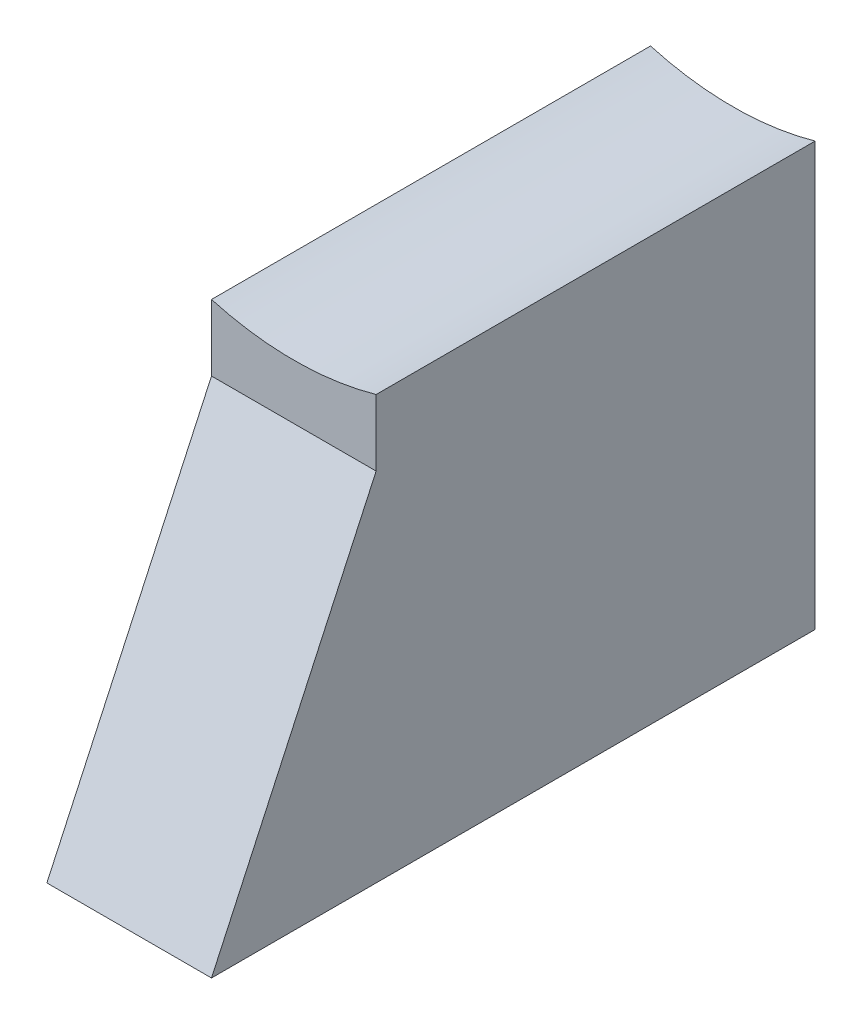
ISO-10303-21;
HEADER;
FILE_DESCRIPTION(('STEP AP214'),'2;1');
FILE_NAME('part.step','',(''),(''),'','','');
FILE_SCHEMA(('AUTOMOTIVE_DESIGN { 1 0 10303 214 1 1 1 1 }'));
ENDSEC;
DATA;
#1=APPLICATION_CONTEXT('core data for automotive mechanical design processes');
#2=APPLICATION_PROTOCOL_DEFINITION('international standard','automotive_design',2000,#1);
#3=PRODUCT_CONTEXT('',#1,'mechanical');
#4=PRODUCT('Part','Part','',(#3));
#5=PRODUCT_RELATED_PRODUCT_CATEGORY('part','',(#4));
#6=PRODUCT_DEFINITION_FORMATION('','',#4);
#7=PRODUCT_DEFINITION_CONTEXT('part definition',#1,'design');
#8=PRODUCT_DEFINITION('design','',#6,#7);
#9=PRODUCT_DEFINITION_SHAPE('','',#8);
#10=(LENGTH_UNIT() NAMED_UNIT(*) SI_UNIT(.MILLI.,.METRE.));
#11=(NAMED_UNIT(*) PLANE_ANGLE_UNIT() SI_UNIT($,.RADIAN.));
#12=(NAMED_UNIT(*) SI_UNIT($,.STERADIAN.) SOLID_ANGLE_UNIT());
#13=UNCERTAINTY_MEASURE_WITH_UNIT(LENGTH_MEASURE(1.E-05),#10,'distance_accuracy_value','');
#14=(GEOMETRIC_REPRESENTATION_CONTEXT(3) GLOBAL_UNCERTAINTY_ASSIGNED_CONTEXT((#13)) GLOBAL_UNIT_ASSIGNED_CONTEXT((#10,
#11,#12)) REPRESENTATION_CONTEXT('',''));
#15=CARTESIAN_POINT('',(0.,0.,0.));
#16=DIRECTION('',(0.,0.,1.));
#17=DIRECTION('',(1.,0.,0.));
#18=AXIS2_PLACEMENT_3D('',#15,#16,#17);
#19=CARTESIAN_POINT('',(3.,6.,22.));
#20=DIRECTION('',(0.,-0.419058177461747,-0.907959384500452));
#21=DIRECTION('',(0.,0.907959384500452,-0.419058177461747));
#22=AXIS2_PLACEMENT_3D('',#19,#20,#21);
#23=PLANE('',#22);
#24=DIRECTION('',(0.,-0.907959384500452,0.419058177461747));
#25=VECTOR('',#24,1.);
#26=CARTESIAN_POINT('',(-3.,6.,22.));
#27=LINE('',#26,#25);
#28=CARTESIAN_POINT('',(-3.,19.,16.));
#29=VERTEX_POINT('',#28);
#30=CARTESIAN_POINT('',(-3.,6.00000000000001,22.));
#31=VERTEX_POINT('',#30);
#32=EDGE_CURVE('E95',#29,#31,#27,.T.);
#33=ORIENTED_EDGE('',*,*,#32,.T.);
#34=DIRECTION('',(-1.,0.,0.));
#35=VECTOR('',#34,1.);
#36=CARTESIAN_POINT('',(3.,6.,22.));
#37=LINE('',#36,#35);
#38=CARTESIAN_POINT('',(3.,6.,22.));
#39=VERTEX_POINT('',#38);
#40=EDGE_CURVE('E92',#39,#31,#37,.T.);
#41=ORIENTED_EDGE('',*,*,#40,.F.);
#42=DIRECTION('',(0.,-0.907959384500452,0.419058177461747));
#43=VECTOR('',#42,1.);
#44=CARTESIAN_POINT('',(3.,6.,22.));
#45=LINE('',#44,#43);
#46=CARTESIAN_POINT('',(3.,19.,16.));
#47=VERTEX_POINT('',#46);
#48=EDGE_CURVE('E111',#47,#39,#45,.T.);
#49=ORIENTED_EDGE('',*,*,#48,.F.);
#50=DIRECTION('',(-1.,0.,0.));
#51=VECTOR('',#50,1.);
#52=CARTESIAN_POINT('',(3.,19.,16.));
#53=LINE('',#52,#51);
#54=EDGE_CURVE('E117',#47,#29,#53,.T.);
#55=ORIENTED_EDGE('',*,*,#54,.T.);
#56=EDGE_LOOP('',(#33,#41,#49,#55));
#57=FACE_BOUND('',#56,.T.);
#58=ADVANCED_FACE('F34',(#57),#23,.F.);
#59=CARTESIAN_POINT('',(-3.,22.8369591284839,16.));
#60=DIRECTION('',(-1.,0.,0.));
#61=DIRECTION('',(0.,0.,1.));
#62=AXIS2_PLACEMENT_3D('',#59,#60,#61);
#63=PLANE('',#62);
#64=DIRECTION('',(0.,0.,-1.));
#65=VECTOR('',#64,1.);
#66=CARTESIAN_POINT('',(-3.,21.4169947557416,18.));
#67=LINE('',#66,#65);
#68=CARTESIAN_POINT('',(-3.,21.4169947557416,0.));
#69=VERTEX_POINT('',#68);
#70=CARTESIAN_POINT('',(-3.,21.4169947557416,16.));
#71=VERTEX_POINT('',#70);
#72=EDGE_CURVE('E49',#69,#71,#67,.F.);
#73=ORIENTED_EDGE('',*,*,#72,.F.);
#74=DIRECTION('',(0.,-1.,0.));
#75=VECTOR('',#74,1.);
#76=CARTESIAN_POINT('',(-3.,6.,0.));
#77=LINE('',#76,#75);
#78=CARTESIAN_POINT('',(-3.,6.,0.));
#79=VERTEX_POINT('',#78);
#80=EDGE_CURVE('E98',#69,#79,#77,.T.);
#81=ORIENTED_EDGE('',*,*,#80,.T.);
#82=DIRECTION('',(0.,0.,-1.));
#83=VECTOR('',#82,1.);
#84=CARTESIAN_POINT('',(-3.,6.,6.));
#85=LINE('',#84,#83);
#86=EDGE_CURVE('E86',#31,#79,#85,.T.);
#87=ORIENTED_EDGE('',*,*,#86,.F.);
#88=ORIENTED_EDGE('',*,*,#32,.F.);
#89=DIRECTION('',(0.,-1.,0.));
#90=VECTOR('',#89,1.);
#91=CARTESIAN_POINT('',(-3.,19.,16.));
#92=LINE('',#91,#90);
#93=EDGE_CURVE('E69',#71,#29,#92,.T.);
#94=ORIENTED_EDGE('',*,*,#93,.F.);
#95=EDGE_LOOP('',(#73,#81,#87,#88,#94));
#96=FACE_BOUND('',#95,.T.);
#97=ADVANCED_FACE('F99',(#96),#63,.T.);
#98=CARTESIAN_POINT('',(3.,22.8369591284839,16.));
#99=DIRECTION('',(-1.,0.,0.));
#100=DIRECTION('',(0.,0.,1.));
#101=AXIS2_PLACEMENT_3D('',#98,#99,#100);
#102=PLANE('',#101);
#103=DIRECTION('',(0.,0.,-1.));
#104=VECTOR('',#103,1.);
#105=CARTESIAN_POINT('',(3.,6.,6.));
#106=LINE('',#105,#104);
#107=CARTESIAN_POINT('',(3.,6.,0.));
#108=VERTEX_POINT('',#107);
#109=EDGE_CURVE('E58',#39,#108,#106,.T.);
#110=ORIENTED_EDGE('',*,*,#109,.T.);
#111=DIRECTION('',(0.,1.,0.));
#112=VECTOR('',#111,1.);
#113=CARTESIAN_POINT('',(3.,6.,0.));
#114=LINE('',#113,#112);
#115=CARTESIAN_POINT('',(3.,21.4169947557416,0.));
#116=VERTEX_POINT('',#115);
#117=EDGE_CURVE('E104',#108,#116,#114,.T.);
#118=ORIENTED_EDGE('',*,*,#117,.T.);
#119=DIRECTION('',(0.,0.,-1.));
#120=VECTOR('',#119,1.);
#121=CARTESIAN_POINT('',(3.,21.4169947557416,18.));
#122=LINE('',#121,#120);
#123=CARTESIAN_POINT('',(3.,21.4169947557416,16.));
#124=VERTEX_POINT('',#123);
#125=EDGE_CURVE('E12',#116,#124,#122,.F.);
#126=ORIENTED_EDGE('',*,*,#125,.T.);
#127=DIRECTION('',(0.,-1.,0.));
#128=VECTOR('',#127,1.);
#129=CARTESIAN_POINT('',(3.,19.,16.));
#130=LINE('',#129,#128);
#131=EDGE_CURVE('E94',#124,#47,#130,.T.);
#132=ORIENTED_EDGE('',*,*,#131,.T.);
#133=ORIENTED_EDGE('',*,*,#48,.T.);
#134=EDGE_LOOP('',(#110,#118,#126,#132,#133));
#135=FACE_BOUND('',#134,.T.);
#136=ADVANCED_FACE('F124',(#135),#102,.F.);
#137=CARTESIAN_POINT('',(3.,19.,16.));
#138=DIRECTION('',(0.,0.,-1.));
#139=DIRECTION('',(-1.,0.,0.));
#140=AXIS2_PLACEMENT_3D('',#137,#138,#139);
#141=PLANE('',#140);
#142=ORIENTED_EDGE('',*,*,#131,.F.);
#143=CARTESIAN_POINT('',(0.,32.,16.));
#144=DIRECTION('',(0.,0.,-1.));
#145=DIRECTION('',(-1.,0.,0.));
#146=AXIS2_PLACEMENT_3D('',#143,#144,#145);
#147=CIRCLE('',#146,11.);
#148=EDGE_CURVE('E42',#124,#71,#147,.T.);
#149=ORIENTED_EDGE('',*,*,#148,.T.);
#150=ORIENTED_EDGE('',*,*,#93,.T.);
#151=ORIENTED_EDGE('',*,*,#54,.F.);
#152=EDGE_LOOP('',(#142,#149,#150,#151));
#153=FACE_BOUND('',#152,.T.);
#154=ADVANCED_FACE('F121',(#153),#141,.F.);
#155=CARTESIAN_POINT('',(0.,32.,-28.));
#156=DIRECTION('',(0.,0.,1.));
#157=DIRECTION('',(1.,0.,0.));
#158=AXIS2_PLACEMENT_3D('',#155,#156,#157);
#159=CYLINDRICAL_SURFACE('',#158,11.);
#160=CARTESIAN_POINT('',(0.,32.,0.));
#161=DIRECTION('',(0.,0.,1.));
#162=DIRECTION('',(1.,0.,0.));
#163=AXIS2_PLACEMENT_3D('',#160,#161,#162);
#164=CIRCLE('',#163,11.);
#165=EDGE_CURVE('E106',#116,#69,#164,.F.);
#166=ORIENTED_EDGE('',*,*,#165,.T.);
#167=ORIENTED_EDGE('',*,*,#72,.T.);
#168=ORIENTED_EDGE('',*,*,#148,.F.);
#169=ORIENTED_EDGE('',*,*,#125,.F.);
#170=EDGE_LOOP('',(#166,#167,#168,#169));
#171=FACE_BOUND('',#170,.T.);
#172=ADVANCED_FACE('F134',(#171),#159,.F.);
#173=CARTESIAN_POINT('',(-3.,6.,-28.));
#174=DIRECTION('',(0.,-1.,0.));
#175=DIRECTION('',(1.,0.,0.));
#176=AXIS2_PLACEMENT_3D('',#173,#174,#175);
#177=PLANE('',#176);
#178=DIRECTION('',(1.,0.,0.));
#179=VECTOR('',#178,1.);
#180=CARTESIAN_POINT('',(30.,5.99999999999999,0.));
#181=LINE('',#180,#179);
#182=EDGE_CURVE('E89',#79,#108,#181,.T.);
#183=ORIENTED_EDGE('',*,*,#182,.T.);
#184=ORIENTED_EDGE('',*,*,#109,.F.);
#185=ORIENTED_EDGE('',*,*,#40,.T.);
#186=ORIENTED_EDGE('',*,*,#86,.T.);
#187=EDGE_LOOP('',(#183,#184,#185,#186));
#188=FACE_BOUND('',#187,.T.);
#189=ADVANCED_FACE('F87',(#188),#177,.T.);
#190=CARTESIAN_POINT('',(30.,6.,0.));
#191=DIRECTION('',(0.,0.,1.));
#192=DIRECTION('',(1.,0.,0.));
#193=AXIS2_PLACEMENT_3D('',#190,#191,#192);
#194=PLANE('',#193);
#195=ORIENTED_EDGE('',*,*,#117,.F.);
#196=ORIENTED_EDGE('',*,*,#182,.F.);
#197=ORIENTED_EDGE('',*,*,#80,.F.);
#198=ORIENTED_EDGE('',*,*,#165,.F.);
#199=EDGE_LOOP('',(#195,#196,#197,#198));
#200=FACE_BOUND('',#199,.T.);
#201=ADVANCED_FACE('F36',(#200),#194,.F.);
#202=CLOSED_SHELL('',(#58,#97,#136,#154,#172,#189,#201));
#203=MANIFOLD_SOLID_BREP('B2',#202);
#204=ADVANCED_BREP_SHAPE_REPRESENTATION('',(#18,#203),#14);
#205=SHAPE_DEFINITION_REPRESENTATION(#9,#204);
ENDSEC;
END-ISO-10303-21;
